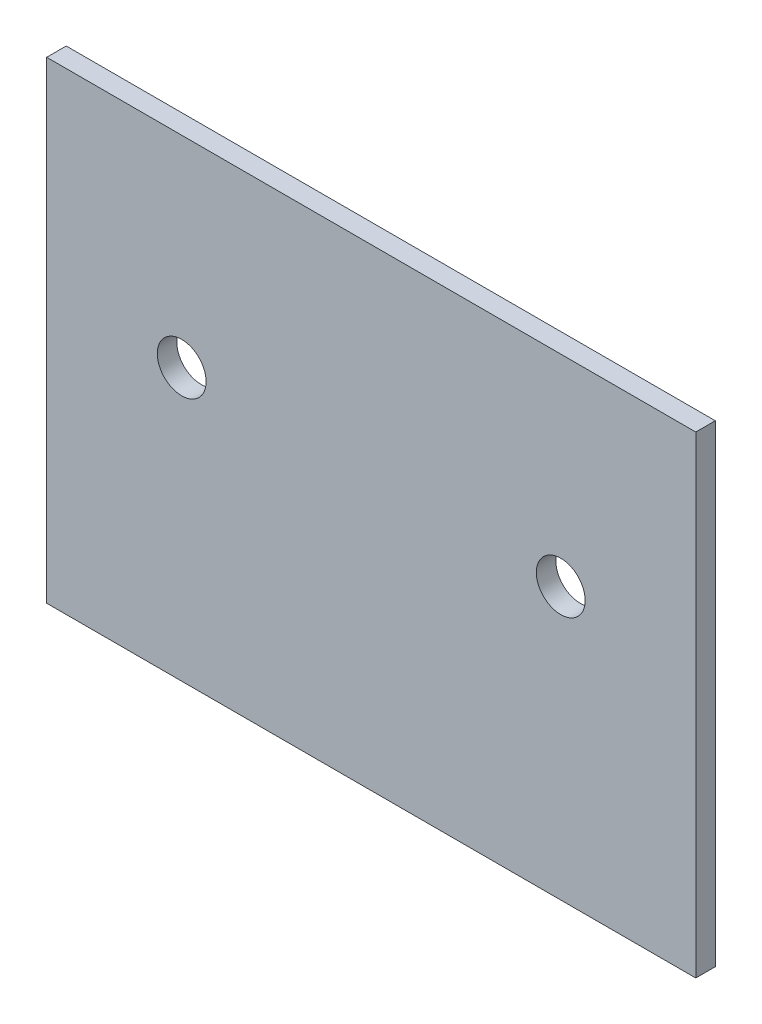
from build123d import *

# Parameters (mm, degrees)
SKETCH1_W           = 33.22
SKETCH1_H           = 24.2
BOSS_EXTRUDE1_DEPTH = 1
SKETCH2_R           = 1.25
CUT_EXTRUDE1_DEPTH  = 1


with BuildPart() as part:
    # Sketch1 → Boss-Extrude1 (new body)
    with BuildSketch(Plane.XY):
        Rectangle(SKETCH1_W, SKETCH1_H)
    extrude(amount=BOSS_EXTRUDE1_DEPTH)

    # Sketch2 → Cut-Extrude1 (cut)
    with BuildSketch(Plane.XY.offset(1)):
        with Locations((9.7, 1.8)):
            Circle(SKETCH2_R)
        with Locations((-9.7, 1.8)):
            Circle(SKETCH2_R)
    extrude(amount=-CUT_EXTRUDE1_DEPTH, mode=Mode.SUBTRACT)


solid = part.part
